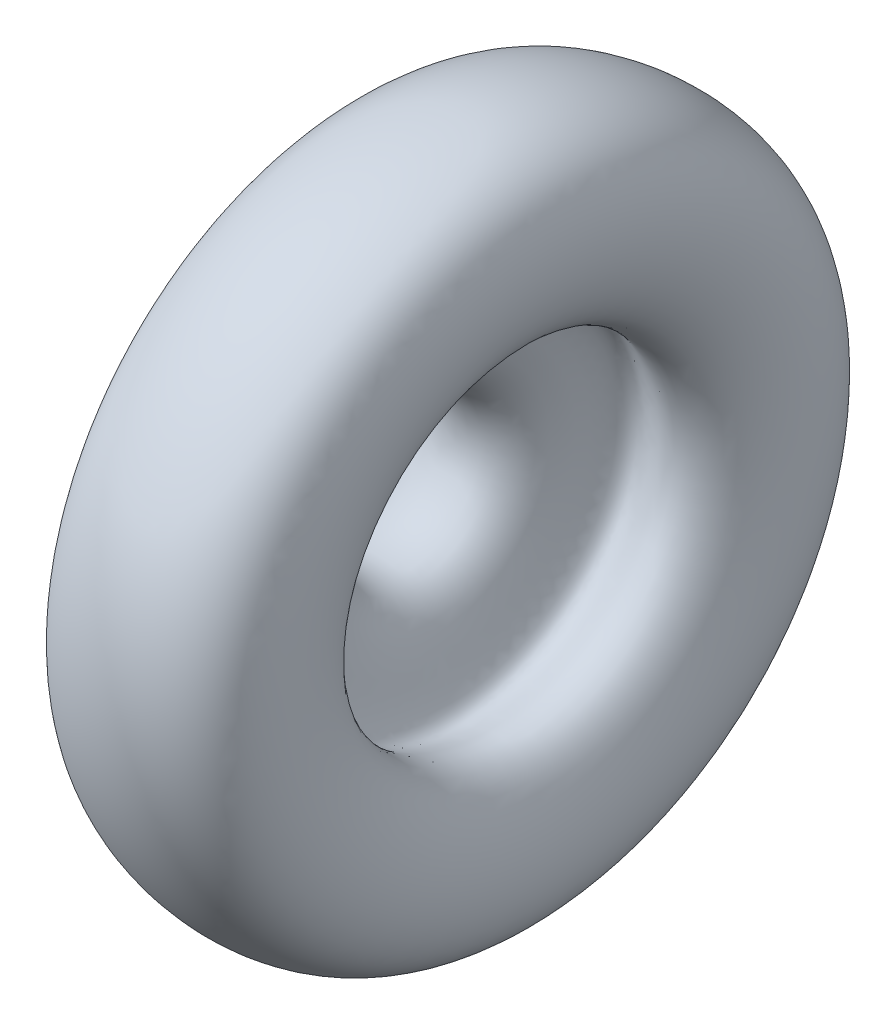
ISO-10303-21;
HEADER;
FILE_DESCRIPTION(('STEP AP214'),'2;1');
FILE_NAME('part.step','',(''),(''),'','','');
FILE_SCHEMA(('AUTOMOTIVE_DESIGN { 1 0 10303 214 1 1 1 1 }'));
ENDSEC;
DATA;
#1=APPLICATION_CONTEXT('core data for automotive mechanical design processes');
#2=APPLICATION_PROTOCOL_DEFINITION('international standard','automotive_design',2000,#1);
#3=PRODUCT_CONTEXT('',#1,'mechanical');
#4=PRODUCT('Part','Part','',(#3));
#5=PRODUCT_RELATED_PRODUCT_CATEGORY('part','',(#4));
#6=PRODUCT_DEFINITION_FORMATION('','',#4);
#7=PRODUCT_DEFINITION_CONTEXT('part definition',#1,'design');
#8=PRODUCT_DEFINITION('design','',#6,#7);
#9=PRODUCT_DEFINITION_SHAPE('','',#8);
#10=(LENGTH_UNIT() NAMED_UNIT(*) SI_UNIT(.MILLI.,.METRE.));
#11=(NAMED_UNIT(*) PLANE_ANGLE_UNIT() SI_UNIT($,.RADIAN.));
#12=(NAMED_UNIT(*) SI_UNIT($,.STERADIAN.) SOLID_ANGLE_UNIT());
#13=UNCERTAINTY_MEASURE_WITH_UNIT(LENGTH_MEASURE(1.E-05),#10,'distance_accuracy_value','');
#14=(GEOMETRIC_REPRESENTATION_CONTEXT(3) GLOBAL_UNCERTAINTY_ASSIGNED_CONTEXT((#13)) GLOBAL_UNIT_ASSIGNED_CONTEXT((#10,
#11,#12)) REPRESENTATION_CONTEXT('',''));
#15=CARTESIAN_POINT('',(0.,0.,0.));
#16=DIRECTION('',(0.,0.,1.));
#17=DIRECTION('',(1.,0.,0.));
#18=AXIS2_PLACEMENT_3D('',#15,#16,#17);
#19=CARTESIAN_POINT('',(0.,0.,0.));
#20=CARTESIAN_POINT('',(6.93759607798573,-29.774158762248,0.));
#21=CARTESIAN_POINT('',(122.18740843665,-55.5410407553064,0.));
#22=CARTESIAN_POINT('',(-42.2943036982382,-223.225447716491,0.));
#23=CARTESIAN_POINT('',(332.518068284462,-300.054721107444,0.));
#24=CARTESIAN_POINT('',(259.620446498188,-10.453804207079,0.));
#25=CARTESIAN_POINT('',(154.884238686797,-63.1374800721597,0.));
#26=CARTESIAN_POINT('',(150.296825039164,22.3598364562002,0.));
#27=CARTESIAN_POINT('',(108.496461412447,69.4240423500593,0.));
#28=CARTESIAN_POINT('',(51.683659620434,69.9678751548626,0.));
#29=CARTESIAN_POINT('',(8.52917374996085,46.0372074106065,0.));
#30=CARTESIAN_POINT('',(-2.84508339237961,12.210276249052,0.));
#31=CARTESIAN_POINT('',(0.,0.,0.));
#32=B_SPLINE_CURVE_WITH_KNOTS('',3,(#19,#20,#21,#22,#23,#24,#25,#26,#27,#28,#29,#30,#31),
.UNSPECIFIED.,.T.,.F.,(4,1,1,1,1,1,1,1,1,1,4),(0.,0.108586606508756,0.230880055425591,
0.469994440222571,0.659583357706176,0.695724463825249,0.784381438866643,0.84230901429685,
0.900764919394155,0.955469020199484,1.),.UNSPECIFIED.);
#33=CARTESIAN_POINT('',(156.636992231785,153.039516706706,0.));
#34=DIRECTION('',(1.,0.,0.));
#35=AXIS1_PLACEMENT('',#33,#34);
#36=SURFACE_OF_REVOLUTION('',#32,#35);
#37=ADVANCED_FACE('F30',(),#36,.T.);
#38=CLOSED_SHELL('',(#37));
#39=MANIFOLD_SOLID_BREP('B2',#38);
#40=ADVANCED_BREP_SHAPE_REPRESENTATION('',(#18,#39),#14);
#41=SHAPE_DEFINITION_REPRESENTATION(#9,#40);
ENDSEC;
END-ISO-10303-21;
